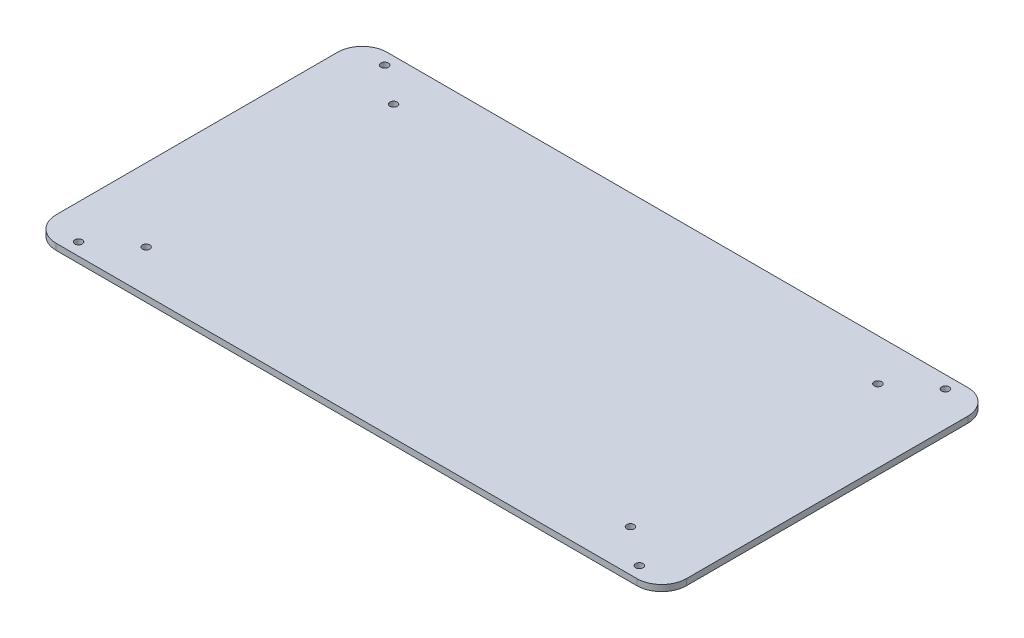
ISO-10303-21;
HEADER;
FILE_DESCRIPTION(('STEP AP214'),'2;1');
FILE_NAME('part.step','',(''),(''),'','','');
FILE_SCHEMA(('AUTOMOTIVE_DESIGN { 1 0 10303 214 1 1 1 1 }'));
ENDSEC;
DATA;
#1=APPLICATION_CONTEXT('core data for automotive mechanical design processes');
#2=APPLICATION_PROTOCOL_DEFINITION('international standard','automotive_design',2000,#1);
#3=PRODUCT_CONTEXT('',#1,'mechanical');
#4=PRODUCT('Part','Part','',(#3));
#5=PRODUCT_RELATED_PRODUCT_CATEGORY('part','',(#4));
#6=PRODUCT_DEFINITION_FORMATION('','',#4);
#7=PRODUCT_DEFINITION_CONTEXT('part definition',#1,'design');
#8=PRODUCT_DEFINITION('design','',#6,#7);
#9=PRODUCT_DEFINITION_SHAPE('','',#8);
#10=(LENGTH_UNIT() NAMED_UNIT(*) SI_UNIT(.MILLI.,.METRE.));
#11=(NAMED_UNIT(*) PLANE_ANGLE_UNIT() SI_UNIT($,.RADIAN.));
#12=(NAMED_UNIT(*) SI_UNIT($,.STERADIAN.) SOLID_ANGLE_UNIT());
#13=UNCERTAINTY_MEASURE_WITH_UNIT(LENGTH_MEASURE(1.E-05),#10,'distance_accuracy_value','');
#14=(GEOMETRIC_REPRESENTATION_CONTEXT(3) GLOBAL_UNCERTAINTY_ASSIGNED_CONTEXT((#13)) GLOBAL_UNIT_ASSIGNED_CONTEXT((#10,
#11,#12)) REPRESENTATION_CONTEXT('',''));
#15=CARTESIAN_POINT('',(0.,0.,0.));
#16=DIRECTION('',(0.,0.,1.));
#17=DIRECTION('',(1.,0.,0.));
#18=AXIS2_PLACEMENT_3D('',#15,#16,#17);
#19=CARTESIAN_POINT('',(0.,2.5,0.));
#20=DIRECTION('',(0.,1.,0.));
#21=DIRECTION('',(0.,0.,1.));
#22=AXIS2_PLACEMENT_3D('',#19,#20,#21);
#23=PLANE('',#22);
#24=CARTESIAN_POINT('',(-97.5970139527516,2.5,49.8596440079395));
#25=DIRECTION('',(0.,-1.,0.));
#26=DIRECTION('',(0.,0.,-1.));
#27=AXIS2_PLACEMENT_3D('',#24,#25,#26);
#28=CIRCLE('',#27,1.5);
#29=CARTESIAN_POINT('',(-97.5970139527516,2.5,48.3596440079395));
#30=VERTEX_POINT('',#29);
#31=EDGE_CURVE('E199',#30,#30,#28,.T.);
#32=ORIENTED_EDGE('',*,*,#31,.T.);
#33=EDGE_LOOP('',(#32));
#34=FACE_BOUND('',#33,.T.);
#35=CARTESIAN_POINT('',(97.5970139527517,2.5,-49.8596440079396));
#36=DIRECTION('',(0.,1.,0.));
#37=DIRECTION('',(0.,0.,1.));
#38=AXIS2_PLACEMENT_3D('',#35,#36,#37);
#39=CIRCLE('',#38,1.5);
#40=CARTESIAN_POINT('',(97.5970139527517,2.5,-48.3596440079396));
#41=VERTEX_POINT('',#40);
#42=EDGE_CURVE('E183',#41,#41,#39,.F.);
#43=ORIENTED_EDGE('',*,*,#42,.T.);
#44=EDGE_LOOP('',(#43));
#45=FACE_BOUND('',#44,.T.);
#46=CARTESIAN_POINT('',(-113.,2.5,61.675));
#47=DIRECTION('',(0.,1.,0.));
#48=DIRECTION('',(0.,0.,1.));
#49=AXIS2_PLACEMENT_3D('',#46,#47,#48);
#50=CIRCLE('',#49,1.5);
#51=CARTESIAN_POINT('',(-113.,2.5,63.175));
#52=VERTEX_POINT('',#51);
#53=EDGE_CURVE('E168',#52,#52,#50,.F.);
#54=ORIENTED_EDGE('',*,*,#53,.T.);
#55=EDGE_LOOP('',(#54));
#56=FACE_BOUND('',#55,.T.);
#57=CARTESIAN_POINT('',(113.,2.5,-61.675));
#58=DIRECTION('',(0.,1.,0.));
#59=DIRECTION('',(0.,0.,1.));
#60=AXIS2_PLACEMENT_3D('',#57,#58,#59);
#61=CIRCLE('',#60,1.5);
#62=CARTESIAN_POINT('',(113.,2.5,-60.175));
#63=VERTEX_POINT('',#62);
#64=EDGE_CURVE('E177',#63,#63,#61,.F.);
#65=ORIENTED_EDGE('',*,*,#64,.T.);
#66=EDGE_LOOP('',(#65));
#67=FACE_BOUND('',#66,.T.);
#68=CARTESIAN_POINT('',(113.,2.5,61.675));
#69=DIRECTION('',(0.,1.,0.));
#70=DIRECTION('',(0.,0.,1.));
#71=AXIS2_PLACEMENT_3D('',#68,#69,#70);
#72=CIRCLE('',#71,1.5);
#73=CARTESIAN_POINT('',(113.,2.5,63.175));
#74=VERTEX_POINT('',#73);
#75=EDGE_CURVE('E172',#74,#74,#72,.F.);
#76=ORIENTED_EDGE('',*,*,#75,.T.);
#77=EDGE_LOOP('',(#76));
#78=FACE_BOUND('',#77,.T.);
#79=CARTESIAN_POINT('',(-113.,2.5,-61.675));
#80=DIRECTION('',(0.,1.,0.));
#81=DIRECTION('',(0.,0.,1.));
#82=AXIS2_PLACEMENT_3D('',#79,#80,#81);
#83=CIRCLE('',#82,1.5);
#84=CARTESIAN_POINT('',(-113.,2.5,-60.175));
#85=VERTEX_POINT('',#84);
#86=EDGE_CURVE('E130',#85,#85,#83,.F.);
#87=ORIENTED_EDGE('',*,*,#86,.T.);
#88=EDGE_LOOP('',(#87));
#89=FACE_BOUND('',#88,.T.);
#90=DIRECTION('',(1.,0.,0.));
#91=VECTOR('',#90,1.);
#92=CARTESIAN_POINT('',(-127.,2.5,66.675));
#93=LINE('',#92,#91);
#94=CARTESIAN_POINT('',(-117.,2.5,66.675));
#95=VERTEX_POINT('',#94);
#96=CARTESIAN_POINT('',(117.,2.5,66.675));
#97=VERTEX_POINT('',#96);
#98=EDGE_CURVE('E139',#95,#97,#93,.T.);
#99=ORIENTED_EDGE('',*,*,#98,.T.);
#100=CARTESIAN_POINT('',(117.,2.5,56.675));
#101=DIRECTION('',(0.,1.,0.));
#102=DIRECTION('',(0.,0.,1.));
#103=AXIS2_PLACEMENT_3D('',#100,#101,#102);
#104=CIRCLE('',#103,10.);
#105=CARTESIAN_POINT('',(127.,2.5,56.675));
#106=VERTEX_POINT('',#105);
#107=EDGE_CURVE('E158',#97,#106,#104,.T.);
#108=ORIENTED_EDGE('',*,*,#107,.T.);
#109=DIRECTION('',(0.,0.,-1.));
#110=VECTOR('',#109,1.);
#111=CARTESIAN_POINT('',(127.,2.5,-66.675));
#112=LINE('',#111,#110);
#113=CARTESIAN_POINT('',(127.,2.5,-56.675));
#114=VERTEX_POINT('',#113);
#115=EDGE_CURVE('E122',#106,#114,#112,.T.);
#116=ORIENTED_EDGE('',*,*,#115,.T.);
#117=CARTESIAN_POINT('',(117.,2.5,-56.675));
#118=DIRECTION('',(0.,1.,0.));
#119=DIRECTION('',(0.,0.,1.));
#120=AXIS2_PLACEMENT_3D('',#117,#118,#119);
#121=CIRCLE('',#120,10.);
#122=CARTESIAN_POINT('',(117.,2.5,-66.675));
#123=VERTEX_POINT('',#122);
#124=EDGE_CURVE('E156',#114,#123,#121,.T.);
#125=ORIENTED_EDGE('',*,*,#124,.T.);
#126=DIRECTION('',(-1.,0.,0.));
#127=VECTOR('',#126,1.);
#128=CARTESIAN_POINT('',(-127.,2.5,-66.675));
#129=LINE('',#128,#127);
#130=CARTESIAN_POINT('',(-117.,2.5,-66.675));
#131=VERTEX_POINT('',#130);
#132=EDGE_CURVE('E208',#123,#131,#129,.T.);
#133=ORIENTED_EDGE('',*,*,#132,.T.);
#134=CARTESIAN_POINT('',(-117.,2.5,-56.675));
#135=DIRECTION('',(0.,1.,0.));
#136=DIRECTION('',(0.,0.,1.));
#137=AXIS2_PLACEMENT_3D('',#134,#135,#136);
#138=CIRCLE('',#137,10.);
#139=CARTESIAN_POINT('',(-127.,2.5,-56.675));
#140=VERTEX_POINT('',#139);
#141=EDGE_CURVE('E57',#131,#140,#138,.T.);
#142=ORIENTED_EDGE('',*,*,#141,.T.);
#143=DIRECTION('',(0.,0.,1.));
#144=VECTOR('',#143,1.);
#145=CARTESIAN_POINT('',(-127.,2.5,-66.675));
#146=LINE('',#145,#144);
#147=CARTESIAN_POINT('',(-127.,2.5,56.675));
#148=VERTEX_POINT('',#147);
#149=EDGE_CURVE('E209',#140,#148,#146,.T.);
#150=ORIENTED_EDGE('',*,*,#149,.T.);
#151=CARTESIAN_POINT('',(-117.,2.5,56.675));
#152=DIRECTION('',(0.,1.,0.));
#153=DIRECTION('',(0.,0.,1.));
#154=AXIS2_PLACEMENT_3D('',#151,#152,#153);
#155=CIRCLE('',#154,10.);
#156=EDGE_CURVE('E153',#148,#95,#155,.T.);
#157=ORIENTED_EDGE('',*,*,#156,.T.);
#158=EDGE_LOOP('',(#99,#108,#116,#125,#133,#142,#150,#157));
#159=FACE_BOUND('',#158,.T.);
#160=CARTESIAN_POINT('',(-97.5970139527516,2.5,-49.8596440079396));
#161=DIRECTION('',(0.,1.,0.));
#162=DIRECTION('',(0.,0.,1.));
#163=AXIS2_PLACEMENT_3D('',#160,#161,#162);
#164=CIRCLE('',#163,1.5);
#165=CARTESIAN_POINT('',(-97.5970139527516,2.5,-48.3596440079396));
#166=VERTEX_POINT('',#165);
#167=EDGE_CURVE('E387',#166,#166,#164,.T.);
#168=ORIENTED_EDGE('',*,*,#167,.F.);
#169=EDGE_LOOP('',(#168));
#170=FACE_BOUND('',#169,.T.);
#171=CARTESIAN_POINT('',(97.5970139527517,2.5,49.8596440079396));
#172=DIRECTION('',(0.,1.,0.));
#173=DIRECTION('',(0.,0.,1.));
#174=AXIS2_PLACEMENT_3D('',#171,#172,#173);
#175=CIRCLE('',#174,1.5);
#176=CARTESIAN_POINT('',(97.5970139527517,2.5,51.3596440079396));
#177=VERTEX_POINT('',#176);
#178=EDGE_CURVE('E187',#177,#177,#175,.T.);
#179=ORIENTED_EDGE('',*,*,#178,.F.);
#180=EDGE_LOOP('',(#179));
#181=FACE_BOUND('',#180,.T.);
#182=ADVANCED_FACE('F34',(#34,#45,#56,#67,#78,#89,#159,#170,#181),#23,.T.);
#183=CARTESIAN_POINT('',(0.,0.,0.));
#184=DIRECTION('',(0.,1.,0.));
#185=DIRECTION('',(0.,0.,1.));
#186=AXIS2_PLACEMENT_3D('',#183,#184,#185);
#187=PLANE('',#186);
#188=CARTESIAN_POINT('',(-97.5970139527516,0.,-49.8596440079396));
#189=DIRECTION('',(0.,1.,0.));
#190=DIRECTION('',(0.,0.,1.));
#191=AXIS2_PLACEMENT_3D('',#188,#189,#190);
#192=CIRCLE('',#191,1.5);
#193=CARTESIAN_POINT('',(-97.5970139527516,0.,-48.3596440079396));
#194=VERTEX_POINT('',#193);
#195=EDGE_CURVE('E186',#194,#194,#192,.T.);
#196=ORIENTED_EDGE('',*,*,#195,.T.);
#197=EDGE_LOOP('',(#196));
#198=FACE_BOUND('',#197,.T.);
#199=CARTESIAN_POINT('',(-97.5970139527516,0.,49.8596440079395));
#200=DIRECTION('',(0.,1.,0.));
#201=DIRECTION('',(0.,0.,1.));
#202=AXIS2_PLACEMENT_3D('',#199,#200,#201);
#203=CIRCLE('',#202,1.5);
#204=CARTESIAN_POINT('',(-97.5970139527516,0.,51.3596440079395));
#205=VERTEX_POINT('',#204);
#206=EDGE_CURVE('E184',#205,#205,#203,.F.);
#207=ORIENTED_EDGE('',*,*,#206,.F.);
#208=EDGE_LOOP('',(#207));
#209=FACE_BOUND('',#208,.T.);
#210=CARTESIAN_POINT('',(97.5970139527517,0.,-49.8596440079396));
#211=DIRECTION('',(0.,1.,0.));
#212=DIRECTION('',(0.,0.,1.));
#213=AXIS2_PLACEMENT_3D('',#210,#211,#212);
#214=CIRCLE('',#213,1.5);
#215=CARTESIAN_POINT('',(97.5970139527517,0.,-48.3596440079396));
#216=VERTEX_POINT('',#215);
#217=EDGE_CURVE('E173',#216,#216,#214,.F.);
#218=ORIENTED_EDGE('',*,*,#217,.F.);
#219=EDGE_LOOP('',(#218));
#220=FACE_BOUND('',#219,.T.);
#221=CARTESIAN_POINT('',(-113.,0.,61.675));
#222=DIRECTION('',(0.,1.,0.));
#223=DIRECTION('',(0.,0.,1.));
#224=AXIS2_PLACEMENT_3D('',#221,#222,#223);
#225=CIRCLE('',#224,1.5);
#226=CARTESIAN_POINT('',(-113.,0.,63.175));
#227=VERTEX_POINT('',#226);
#228=EDGE_CURVE('E178',#227,#227,#225,.F.);
#229=ORIENTED_EDGE('',*,*,#228,.F.);
#230=EDGE_LOOP('',(#229));
#231=FACE_BOUND('',#230,.T.);
#232=CARTESIAN_POINT('',(113.,0.,-61.675));
#233=DIRECTION('',(0.,1.,0.));
#234=DIRECTION('',(0.,0.,1.));
#235=AXIS2_PLACEMENT_3D('',#232,#233,#234);
#236=CIRCLE('',#235,1.5);
#237=CARTESIAN_POINT('',(113.,0.,-60.175));
#238=VERTEX_POINT('',#237);
#239=EDGE_CURVE('E174',#238,#238,#236,.F.);
#240=ORIENTED_EDGE('',*,*,#239,.F.);
#241=EDGE_LOOP('',(#240));
#242=FACE_BOUND('',#241,.T.);
#243=CARTESIAN_POINT('',(113.,0.,61.675));
#244=DIRECTION('',(0.,1.,0.));
#245=DIRECTION('',(0.,0.,1.));
#246=AXIS2_PLACEMENT_3D('',#243,#244,#245);
#247=CIRCLE('',#246,1.5);
#248=CARTESIAN_POINT('',(113.,0.,63.175));
#249=VERTEX_POINT('',#248);
#250=EDGE_CURVE('E169',#249,#249,#247,.F.);
#251=ORIENTED_EDGE('',*,*,#250,.F.);
#252=EDGE_LOOP('',(#251));
#253=FACE_BOUND('',#252,.T.);
#254=CARTESIAN_POINT('',(-113.,0.,-61.675));
#255=DIRECTION('',(0.,1.,0.));
#256=DIRECTION('',(0.,0.,1.));
#257=AXIS2_PLACEMENT_3D('',#254,#255,#256);
#258=CIRCLE('',#257,1.5);
#259=CARTESIAN_POINT('',(-113.,0.,-60.175));
#260=VERTEX_POINT('',#259);
#261=EDGE_CURVE('E136',#260,#260,#258,.F.);
#262=ORIENTED_EDGE('',*,*,#261,.F.);
#263=EDGE_LOOP('',(#262));
#264=FACE_BOUND('',#263,.T.);
#265=DIRECTION('',(0.,0.,-1.));
#266=VECTOR('',#265,1.);
#267=CARTESIAN_POINT('',(127.,0.,-66.675));
#268=LINE('',#267,#266);
#269=CARTESIAN_POINT('',(127.,0.,56.675));
#270=VERTEX_POINT('',#269);
#271=CARTESIAN_POINT('',(127.,0.,-56.675));
#272=VERTEX_POINT('',#271);
#273=EDGE_CURVE('E119',#270,#272,#268,.T.);
#274=ORIENTED_EDGE('',*,*,#273,.F.);
#275=CARTESIAN_POINT('',(117.,0.,56.675));
#276=DIRECTION('',(0.,1.,0.));
#277=DIRECTION('',(0.,0.,1.));
#278=AXIS2_PLACEMENT_3D('',#275,#276,#277);
#279=CIRCLE('',#278,10.);
#280=CARTESIAN_POINT('',(117.,0.,66.675));
#281=VERTEX_POINT('',#280);
#282=EDGE_CURVE('E102',#270,#281,#279,.F.);
#283=ORIENTED_EDGE('',*,*,#282,.T.);
#284=DIRECTION('',(1.,0.,0.));
#285=VECTOR('',#284,1.);
#286=CARTESIAN_POINT('',(-127.,0.,66.675));
#287=LINE('',#286,#285);
#288=CARTESIAN_POINT('',(-117.,0.,66.675));
#289=VERTEX_POINT('',#288);
#290=EDGE_CURVE('E143',#289,#281,#287,.T.);
#291=ORIENTED_EDGE('',*,*,#290,.F.);
#292=CARTESIAN_POINT('',(-117.,0.,56.675));
#293=DIRECTION('',(0.,1.,0.));
#294=DIRECTION('',(0.,0.,1.));
#295=AXIS2_PLACEMENT_3D('',#292,#293,#294);
#296=CIRCLE('',#295,10.);
#297=CARTESIAN_POINT('',(-127.,0.,56.675));
#298=VERTEX_POINT('',#297);
#299=EDGE_CURVE('E123',#289,#298,#296,.F.);
#300=ORIENTED_EDGE('',*,*,#299,.T.);
#301=DIRECTION('',(0.,0.,1.));
#302=VECTOR('',#301,1.);
#303=CARTESIAN_POINT('',(-127.,0.,-66.675));
#304=LINE('',#303,#302);
#305=CARTESIAN_POINT('',(-127.,0.,-56.675));
#306=VERTEX_POINT('',#305);
#307=EDGE_CURVE('E133',#306,#298,#304,.T.);
#308=ORIENTED_EDGE('',*,*,#307,.F.);
#309=CARTESIAN_POINT('',(-117.,0.,-56.675));
#310=DIRECTION('',(0.,1.,0.));
#311=DIRECTION('',(0.,0.,1.));
#312=AXIS2_PLACEMENT_3D('',#309,#310,#311);
#313=CIRCLE('',#312,10.);
#314=CARTESIAN_POINT('',(-117.,0.,-66.675));
#315=VERTEX_POINT('',#314);
#316=EDGE_CURVE('E147',#306,#315,#313,.F.);
#317=ORIENTED_EDGE('',*,*,#316,.T.);
#318=DIRECTION('',(-1.,0.,0.));
#319=VECTOR('',#318,1.);
#320=CARTESIAN_POINT('',(-127.,0.,-66.675));
#321=LINE('',#320,#319);
#322=CARTESIAN_POINT('',(117.,0.,-66.675));
#323=VERTEX_POINT('',#322);
#324=EDGE_CURVE('E129',#323,#315,#321,.T.);
#325=ORIENTED_EDGE('',*,*,#324,.F.);
#326=CARTESIAN_POINT('',(117.,0.,-56.675));
#327=DIRECTION('',(0.,1.,0.));
#328=DIRECTION('',(0.,0.,1.));
#329=AXIS2_PLACEMENT_3D('',#326,#327,#328);
#330=CIRCLE('',#329,10.);
#331=EDGE_CURVE('E113',#323,#272,#330,.F.);
#332=ORIENTED_EDGE('',*,*,#331,.T.);
#333=EDGE_LOOP('',(#274,#283,#291,#300,#308,#317,#325,#332));
#334=FACE_BOUND('',#333,.T.);
#335=CARTESIAN_POINT('',(97.5970139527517,0.,49.8596440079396));
#336=DIRECTION('',(0.,1.,0.));
#337=DIRECTION('',(0.,0.,1.));
#338=AXIS2_PLACEMENT_3D('',#335,#336,#337);
#339=CIRCLE('',#338,1.5);
#340=CARTESIAN_POINT('',(97.5970139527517,0.,51.3596440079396));
#341=VERTEX_POINT('',#340);
#342=EDGE_CURVE('E38',#341,#341,#339,.T.);
#343=ORIENTED_EDGE('',*,*,#342,.T.);
#344=EDGE_LOOP('',(#343));
#345=FACE_BOUND('',#344,.T.);
#346=ADVANCED_FACE('F126',(#198,#209,#220,#231,#242,#253,#264,#334,#345),#187,.F.);
#347=CARTESIAN_POINT('',(127.,2.5,-66.675));
#348=DIRECTION('',(-1.,0.,0.));
#349=DIRECTION('',(0.,0.,1.));
#350=AXIS2_PLACEMENT_3D('',#347,#348,#349);
#351=PLANE('',#350);
#352=ORIENTED_EDGE('',*,*,#115,.F.);
#353=DIRECTION('',(0.,-1.,0.));
#354=VECTOR('',#353,1.);
#355=CARTESIAN_POINT('',(127.,2.5,56.675));
#356=LINE('',#355,#354);
#357=EDGE_CURVE('E106',#106,#270,#356,.T.);
#358=ORIENTED_EDGE('',*,*,#357,.T.);
#359=ORIENTED_EDGE('',*,*,#273,.T.);
#360=DIRECTION('',(0.,-1.,0.));
#361=VECTOR('',#360,1.);
#362=CARTESIAN_POINT('',(127.,2.5,-56.675));
#363=LINE('',#362,#361);
#364=EDGE_CURVE('E124',#272,#114,#363,.F.);
#365=ORIENTED_EDGE('',*,*,#364,.T.);
#366=EDGE_LOOP('',(#352,#358,#359,#365));
#367=FACE_BOUND('',#366,.T.);
#368=ADVANCED_FACE('F118',(#367),#351,.F.);
#369=CARTESIAN_POINT('',(-127.,2.5,-66.675));
#370=DIRECTION('',(0.,0.,1.));
#371=DIRECTION('',(1.,0.,0.));
#372=AXIS2_PLACEMENT_3D('',#369,#370,#371);
#373=PLANE('',#372);
#374=ORIENTED_EDGE('',*,*,#132,.F.);
#375=DIRECTION('',(0.,-1.,0.));
#376=VECTOR('',#375,1.);
#377=CARTESIAN_POINT('',(117.,2.5,-66.675));
#378=LINE('',#377,#376);
#379=EDGE_CURVE('E162',#123,#323,#378,.T.);
#380=ORIENTED_EDGE('',*,*,#379,.T.);
#381=ORIENTED_EDGE('',*,*,#324,.T.);
#382=DIRECTION('',(0.,-1.,0.));
#383=VECTOR('',#382,1.);
#384=CARTESIAN_POINT('',(-117.,2.5,-66.675));
#385=LINE('',#384,#383);
#386=EDGE_CURVE('E160',#315,#131,#385,.F.);
#387=ORIENTED_EDGE('',*,*,#386,.T.);
#388=EDGE_LOOP('',(#374,#380,#381,#387));
#389=FACE_BOUND('',#388,.T.);
#390=ADVANCED_FACE('F226',(#389),#373,.F.);
#391=CARTESIAN_POINT('',(-127.,2.5,-66.675));
#392=DIRECTION('',(1.,0.,0.));
#393=DIRECTION('',(0.,0.,-1.));
#394=AXIS2_PLACEMENT_3D('',#391,#392,#393);
#395=PLANE('',#394);
#396=ORIENTED_EDGE('',*,*,#149,.F.);
#397=DIRECTION('',(0.,-1.,0.));
#398=VECTOR('',#397,1.);
#399=CARTESIAN_POINT('',(-127.,2.5,-56.675));
#400=LINE('',#399,#398);
#401=EDGE_CURVE('E11',#140,#306,#400,.T.);
#402=ORIENTED_EDGE('',*,*,#401,.T.);
#403=ORIENTED_EDGE('',*,*,#307,.T.);
#404=DIRECTION('',(0.,-1.,0.));
#405=VECTOR('',#404,1.);
#406=CARTESIAN_POINT('',(-127.,2.5,56.675));
#407=LINE('',#406,#405);
#408=EDGE_CURVE('E43',#298,#148,#407,.F.);
#409=ORIENTED_EDGE('',*,*,#408,.T.);
#410=EDGE_LOOP('',(#396,#402,#403,#409));
#411=FACE_BOUND('',#410,.T.);
#412=ADVANCED_FACE('F219',(#411),#395,.F.);
#413=CARTESIAN_POINT('',(-127.,2.5,66.675));
#414=DIRECTION('',(0.,0.,-1.));
#415=DIRECTION('',(-1.,0.,0.));
#416=AXIS2_PLACEMENT_3D('',#413,#414,#415);
#417=PLANE('',#416);
#418=ORIENTED_EDGE('',*,*,#290,.T.);
#419=DIRECTION('',(0.,-1.,0.));
#420=VECTOR('',#419,1.);
#421=CARTESIAN_POINT('',(117.,2.5,66.675));
#422=LINE('',#421,#420);
#423=EDGE_CURVE('E107',#281,#97,#422,.F.);
#424=ORIENTED_EDGE('',*,*,#423,.T.);
#425=ORIENTED_EDGE('',*,*,#98,.F.);
#426=DIRECTION('',(0.,-1.,0.));
#427=VECTOR('',#426,1.);
#428=CARTESIAN_POINT('',(-117.,2.5,66.675));
#429=LINE('',#428,#427);
#430=EDGE_CURVE('E112',#95,#289,#429,.T.);
#431=ORIENTED_EDGE('',*,*,#430,.T.);
#432=EDGE_LOOP('',(#418,#424,#425,#431));
#433=FACE_BOUND('',#432,.T.);
#434=ADVANCED_FACE('F216',(#433),#417,.F.);
#435=CARTESIAN_POINT('',(117.,2.5,56.675));
#436=DIRECTION('',(0.,-1.,0.));
#437=DIRECTION('',(0.,0.,-1.));
#438=AXIS2_PLACEMENT_3D('',#435,#436,#437);
#439=CYLINDRICAL_SURFACE('',#438,10.);
#440=ORIENTED_EDGE('',*,*,#107,.F.);
#441=ORIENTED_EDGE('',*,*,#423,.F.);
#442=ORIENTED_EDGE('',*,*,#282,.F.);
#443=ORIENTED_EDGE('',*,*,#357,.F.);
#444=EDGE_LOOP('',(#440,#441,#442,#443));
#445=FACE_BOUND('',#444,.T.);
#446=ADVANCED_FACE('F105',(#445),#439,.T.);
#447=CARTESIAN_POINT('',(117.,2.5,-56.675));
#448=DIRECTION('',(0.,-1.,0.));
#449=DIRECTION('',(0.,0.,-1.));
#450=AXIS2_PLACEMENT_3D('',#447,#448,#449);
#451=CYLINDRICAL_SURFACE('',#450,10.);
#452=ORIENTED_EDGE('',*,*,#124,.F.);
#453=ORIENTED_EDGE('',*,*,#364,.F.);
#454=ORIENTED_EDGE('',*,*,#331,.F.);
#455=ORIENTED_EDGE('',*,*,#379,.F.);
#456=EDGE_LOOP('',(#452,#453,#454,#455));
#457=FACE_BOUND('',#456,.T.);
#458=ADVANCED_FACE('F230',(#457),#451,.T.);
#459=CARTESIAN_POINT('',(-117.,2.5,-56.675));
#460=DIRECTION('',(0.,-1.,0.));
#461=DIRECTION('',(0.,0.,-1.));
#462=AXIS2_PLACEMENT_3D('',#459,#460,#461);
#463=CYLINDRICAL_SURFACE('',#462,10.);
#464=ORIENTED_EDGE('',*,*,#141,.F.);
#465=ORIENTED_EDGE('',*,*,#386,.F.);
#466=ORIENTED_EDGE('',*,*,#316,.F.);
#467=ORIENTED_EDGE('',*,*,#401,.F.);
#468=EDGE_LOOP('',(#464,#465,#466,#467));
#469=FACE_BOUND('',#468,.T.);
#470=ADVANCED_FACE('F222',(#469),#463,.T.);
#471=CARTESIAN_POINT('',(-117.,2.5,56.675));
#472=DIRECTION('',(0.,-1.,0.));
#473=DIRECTION('',(0.,0.,-1.));
#474=AXIS2_PLACEMENT_3D('',#471,#472,#473);
#475=CYLINDRICAL_SURFACE('',#474,10.);
#476=ORIENTED_EDGE('',*,*,#156,.F.);
#477=ORIENTED_EDGE('',*,*,#408,.F.);
#478=ORIENTED_EDGE('',*,*,#299,.F.);
#479=ORIENTED_EDGE('',*,*,#430,.F.);
#480=EDGE_LOOP('',(#476,#477,#478,#479));
#481=FACE_BOUND('',#480,.T.);
#482=ADVANCED_FACE('F36',(#481),#475,.T.);
#483=CARTESIAN_POINT('',(-113.,8.,-61.675));
#484=DIRECTION('',(0.,-1.,0.));
#485=DIRECTION('',(0.,0.,-1.));
#486=AXIS2_PLACEMENT_3D('',#483,#484,#485);
#487=CYLINDRICAL_SURFACE('',#486,1.5);
#488=ORIENTED_EDGE('',*,*,#86,.F.);
#489=EDGE_LOOP('',(#488));
#490=FACE_BOUND('',#489,.T.);
#491=ORIENTED_EDGE('',*,*,#261,.T.);
#492=EDGE_LOOP('',(#491));
#493=FACE_BOUND('',#492,.T.);
#494=ADVANCED_FACE('F248',(#490,#493),#487,.F.);
#495=CARTESIAN_POINT('',(113.,8.,61.675));
#496=DIRECTION('',(0.,-1.,0.));
#497=DIRECTION('',(0.,0.,-1.));
#498=AXIS2_PLACEMENT_3D('',#495,#496,#497);
#499=CYLINDRICAL_SURFACE('',#498,1.5);
#500=ORIENTED_EDGE('',*,*,#75,.F.);
#501=EDGE_LOOP('',(#500));
#502=FACE_BOUND('',#501,.T.);
#503=ORIENTED_EDGE('',*,*,#250,.T.);
#504=EDGE_LOOP('',(#503));
#505=FACE_BOUND('',#504,.T.);
#506=ADVANCED_FACE('F302',(#502,#505),#499,.F.);
#507=CARTESIAN_POINT('',(113.,8.,-61.675));
#508=DIRECTION('',(0.,-1.,0.));
#509=DIRECTION('',(0.,0.,-1.));
#510=AXIS2_PLACEMENT_3D('',#507,#508,#509);
#511=CYLINDRICAL_SURFACE('',#510,1.5);
#512=ORIENTED_EDGE('',*,*,#64,.F.);
#513=EDGE_LOOP('',(#512));
#514=FACE_BOUND('',#513,.T.);
#515=ORIENTED_EDGE('',*,*,#239,.T.);
#516=EDGE_LOOP('',(#515));
#517=FACE_BOUND('',#516,.T.);
#518=ADVANCED_FACE('F311',(#514,#517),#511,.F.);
#519=CARTESIAN_POINT('',(-113.,8.,61.675));
#520=DIRECTION('',(0.,-1.,0.));
#521=DIRECTION('',(0.,0.,-1.));
#522=AXIS2_PLACEMENT_3D('',#519,#520,#521);
#523=CYLINDRICAL_SURFACE('',#522,1.5);
#524=ORIENTED_EDGE('',*,*,#53,.F.);
#525=EDGE_LOOP('',(#524));
#526=FACE_BOUND('',#525,.T.);
#527=ORIENTED_EDGE('',*,*,#228,.T.);
#528=EDGE_LOOP('',(#527));
#529=FACE_BOUND('',#528,.T.);
#530=ADVANCED_FACE('F319',(#526,#529),#523,.F.);
#531=CARTESIAN_POINT('',(97.5970139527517,-7.5,-49.8596440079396));
#532=DIRECTION('',(0.,1.,0.));
#533=DIRECTION('',(0.,0.,1.));
#534=AXIS2_PLACEMENT_3D('',#531,#532,#533);
#535=CYLINDRICAL_SURFACE('',#534,1.5);
#536=ORIENTED_EDGE('',*,*,#42,.F.);
#537=EDGE_LOOP('',(#536));
#538=FACE_BOUND('',#537,.T.);
#539=ORIENTED_EDGE('',*,*,#217,.T.);
#540=EDGE_LOOP('',(#539));
#541=FACE_BOUND('',#540,.T.);
#542=ADVANCED_FACE('F328',(#538,#541),#535,.F.);
#543=CARTESIAN_POINT('',(-97.5970139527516,-7.5,49.8596440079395));
#544=DIRECTION('',(0.,1.,0.));
#545=DIRECTION('',(0.,0.,1.));
#546=AXIS2_PLACEMENT_3D('',#543,#544,#545);
#547=CYLINDRICAL_SURFACE('',#546,1.5);
#548=ORIENTED_EDGE('',*,*,#31,.F.);
#549=EDGE_LOOP('',(#548));
#550=FACE_BOUND('',#549,.T.);
#551=ORIENTED_EDGE('',*,*,#206,.T.);
#552=EDGE_LOOP('',(#551));
#553=FACE_BOUND('',#552,.T.);
#554=ADVANCED_FACE('F349',(#550,#553),#547,.F.);
#555=CARTESIAN_POINT('',(-97.5970139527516,-7.5,-49.8596440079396));
#556=DIRECTION('',(0.,1.,0.));
#557=DIRECTION('',(0.,0.,1.));
#558=AXIS2_PLACEMENT_3D('',#555,#556,#557);
#559=CYLINDRICAL_SURFACE('',#558,1.5);
#560=ORIENTED_EDGE('',*,*,#167,.T.);
#561=EDGE_LOOP('',(#560));
#562=FACE_BOUND('',#561,.T.);
#563=ORIENTED_EDGE('',*,*,#195,.F.);
#564=EDGE_LOOP('',(#563));
#565=FACE_BOUND('',#564,.T.);
#566=ADVANCED_FACE('F356',(#562,#565),#559,.F.);
#567=CARTESIAN_POINT('',(97.5970139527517,-7.5,49.8596440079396));
#568=DIRECTION('',(0.,1.,0.));
#569=DIRECTION('',(0.,0.,1.));
#570=AXIS2_PLACEMENT_3D('',#567,#568,#569);
#571=CYLINDRICAL_SURFACE('',#570,1.5);
#572=ORIENTED_EDGE('',*,*,#178,.T.);
#573=EDGE_LOOP('',(#572));
#574=FACE_BOUND('',#573,.T.);
#575=ORIENTED_EDGE('',*,*,#342,.F.);
#576=EDGE_LOOP('',(#575));
#577=FACE_BOUND('',#576,.T.);
#578=ADVANCED_FACE('F364',(#574,#577),#571,.F.);
#579=CLOSED_SHELL('',(#182,#346,#368,#390,#412,#434,#446,#458,#470,#482,#494,#506,#518,#530,
#542,#554,#566,#578));
#580=MANIFOLD_SOLID_BREP('B2',#579);
#581=ADVANCED_BREP_SHAPE_REPRESENTATION('',(#18,#580),#14);
#582=SHAPE_DEFINITION_REPRESENTATION(#9,#581);
ENDSEC;
END-ISO-10303-21;
